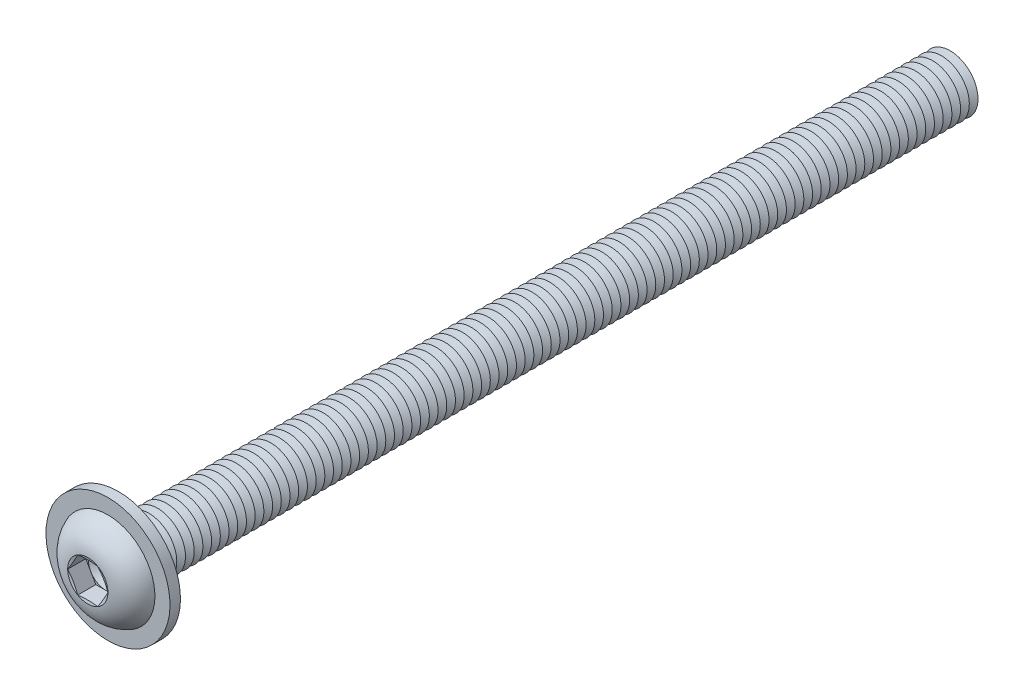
from build123d import *

# Parameters (mm, degrees)
FILLET1_R           = 0.625
LPATTERN1_COUNT     = 96
LPATTERN1_PITCH     = 1.25
CUT_EXTRUDE1_DEPTH  = 2.6
SKETCH5_R           = 8.9
SKETCH5_R_2         = 4.625
BOSS_EXTRUDE1_DEPTH = 1.5


with BuildPart() as part:
    # Sketch1 → Revolve1 (revolve)
    with BuildSketch(Plane(origin=(0, 0, 0), x_dir=(0, 0, -1), z_dir=(1, 0, 0))):
        with BuildLine():
            Line((0, 4), (0, 7))
            ThreePointArc((0, 7), (-3.011595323, 5.81154966), (-4.4, 2.88675))
            Line((-4.4, 2.88675), (-4.013248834, 1.443375))
            Line((-4.013248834, 1.443375), (-4.4, 1.443375))
            Line((-4.4, 1.443375), (-4.4, 0))
            Line((-4.4, 0), (120, 0))
            Line((120, 0), (120, 4))
            Line((120, 4), (0, 4))
        make_face()
    revolve(axis=Axis((0, 0, -120), (0, 0, 1)))

    # Fillet1
    fillet1_edges = [part.edges().sort_by_distance(p)[0] for p in [
        (0, -4, 0),
    ]]
    fillet(fillet1_edges, radius=FILLET1_R)

    # Sketch2 → Cut-Revolve1 (revolve, cut)
    with BuildSketch(Plane(origin=(0, 0, 0), x_dir=(0, 0, -1), z_dir=(1, 0, 0))):
        Polygon((119.375, 4), (120.625, 4), (120, 2.917468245), align=None)
    cut_revolve1 = revolve(axis=Axis((0, 0, -120), (0, 0, -1)), mode=Mode.SUBTRACT)

    # LPattern1: Cut-Revolve1 ×96
    with Locations(*[(0, 0, i * LPATTERN1_PITCH) for i in range(1, LPATTERN1_COUNT)]):
        add(cut_revolve1, mode=Mode.SUBTRACT)

    # Sketch3 → Cut-Extrude1 (cut)
    with BuildSketch(Plane.XY.offset(4.4)):
        Polygon((1.443375, 2.499998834), (-1.443375, 2.499998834), (-2.88675, 0), (-1.443375, -2.499998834), (1.443375, -2.499998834), (2.88675, 0), align=None)
    extrude(amount=-CUT_EXTRUDE1_DEPTH, mode=Mode.SUBTRACT)

    # Cut-Extrude2 cone 1 section (on through the dimple's axis) → Cut-Extrude2 (revolve, cut)
    with BuildSketch(Plane(origin=(0, 0, 1.8), x_dir=(0, -1, 0), z_dir=(1, 0, 0))):
        Polygon((0, 0), (2.499998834, 0), (0, 1.443375), align=None)
    revolve(axis=Axis((0, 0, 1.8), (0, 0, -1)), mode=Mode.SUBTRACT)

    # Sketch5 → Boss-Extrude1 (add)
    with BuildSketch(Plane(origin=(0, 0, 0), x_dir=(-1, 0, 0), z_dir=(0, 0, -1))):
        with Locations(Location((0, 0, 0), (0, 0, 90))):
            Circle(SKETCH5_R)
        Circle(SKETCH5_R_2, mode=Mode.SUBTRACT)
    extrude(amount=-BOSS_EXTRUDE1_DEPTH)


solid = part.part
